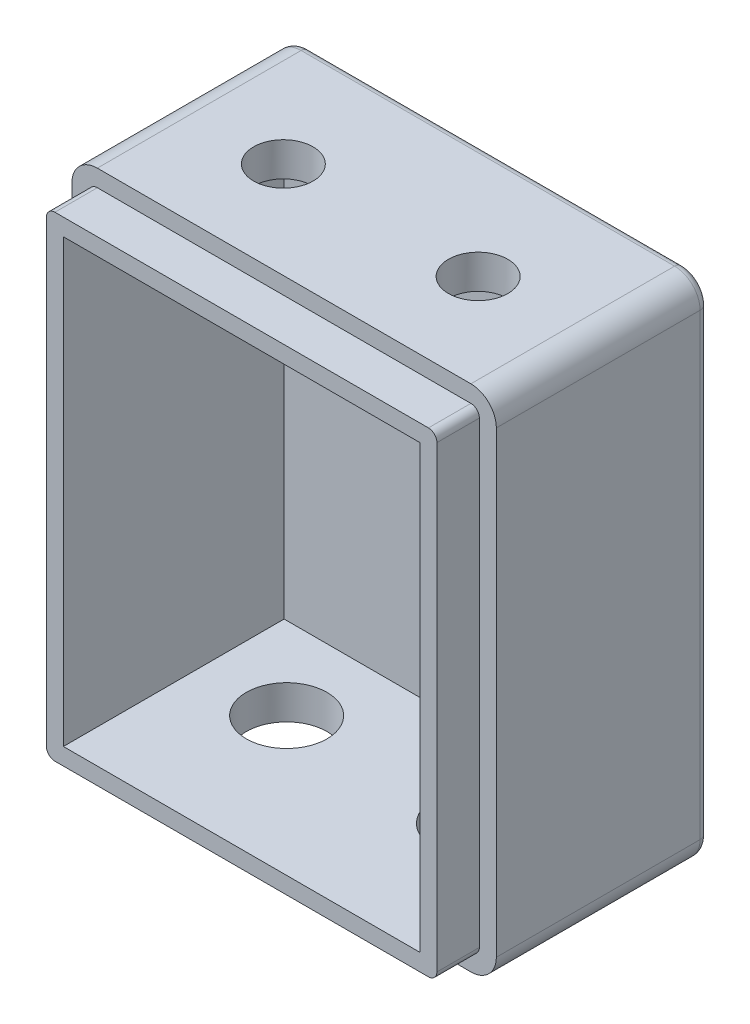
from build123d import *

# Parameters (mm, degrees)
SKETCH1_W           = 50
SKETCH1_H           = 60
BOSS_EXTRUDE1_DEPTH = 30
FILLET1_R           = 3
SHELL1_T            = -4
FILLET4_R           = 1
CUT_EXTRUDE1_DEPTH  = 5
CUT_EXTRUDE2_REACH  = 85.666
SKETCH4_R           = 4.75
CUT_EXTRUDE3_REACH  = 85.666
SKETCH5_R           = 3.5


with BuildPart() as part:
    # Sketch1 → Boss-Extrude1 (new body)
    with BuildSketch(Plane.XY):
        with Locations((25, 30)):
            Rectangle(SKETCH1_W, SKETCH1_H)
    extrude(amount=BOSS_EXTRUDE1_DEPTH)

    # Fillet1
    fillet1_edges = [part.edges().sort_by_distance(p)[0] for p in [
        (0, 60, 15),
        (50, 60, 15),
        (50, 0, 15),
        (0, 0, 15),
    ]]
    fillet(fillet1_edges, radius=FILLET1_R)

    # Shell1
    shell1_openings = [part.faces().sort_by_distance(p)[0] for p in [
        (25, 30, 30),
    ]]
    offset(amount=SHELL1_T, openings=shell1_openings, kind=Kind.INTERSECTION)

    # Fillet4
    fillet4_edges = [part.edges().sort_by_distance(p)[0] for p in [
        (50, 30, 0),
        (0, 30, 0),
        (25, 60, 0),
        (25, 0, 0),
        (49.121320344, 59.121320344, 0),
        (0.878679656, 59.121320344, 0),
        (0.878679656, 0.878679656, 0),
        (49.121320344, 0.878679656, 0),
    ]]
    fillet(fillet4_edges, radius=FILLET4_R)

    # Sketch3 → Cut-Extrude1 (cut)
    with BuildSketch(Plane.XY.offset(30)):
        with BuildLine():
            Line((3, 0), (47, 0))
            ThreePointArc((47, 0), (49.121320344, 0.878679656), (50, 3))
            Line((50, 3), (50, 57))
            ThreePointArc((50, 57), (49.121320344, 59.121320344), (47, 60))
            Line((47, 60), (3, 60))
            ThreePointArc((3, 60), (0.878679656, 59.121320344), (0, 57))
            Line((0, 57), (0, 3))
            ThreePointArc((0, 3), (0.878679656, 0.878679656), (3, 0))
        make_face()
        with BuildLine():
            Line((3, 2), (47, 2))
            ThreePointArc((47, 2), (47.707106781, 2.292893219), (48, 3))
            Line((48, 3), (48, 57))
            ThreePointArc((48, 57), (47.707106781, 57.707106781), (47, 58))
            Line((47, 58), (3, 58))
            ThreePointArc((3, 58), (2.292893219, 57.707106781), (2, 57))
            Line((2, 57), (2, 3))
            ThreePointArc((2, 3), (2.292893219, 2.292893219), (3, 2))
        make_face(mode=Mode.SUBTRACT)
    extrude(amount=-CUT_EXTRUDE1_DEPTH, mode=Mode.SUBTRACT)

    # Sketch4 → Cut-Extrude2 (cut, up to next)
    with BuildSketch(Plane.XZ, mode=Mode.PRIVATE) as cut_extrude2_sk1:
        with Locations(Location((36, 13.700185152, 0), (0, 0, 270))):
            Circle(SKETCH4_R)
    cut_extrude2_tool1 = extrude(cut_extrude2_sk1.sketch, amount=-CUT_EXTRUDE2_REACH, mode=Mode.PRIVATE) & part.part
    # Sketch4 → Cut-Extrude2 (cut, up to next)
    with BuildSketch(Plane.XZ, mode=Mode.PRIVATE) as cut_extrude2_sk2:
        with Locations(Location((14, 13.700185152, 0), (0, 0, 270))):
            Circle(SKETCH4_R)
    cut_extrude2_tool2 = extrude(cut_extrude2_sk2.sketch, amount=-CUT_EXTRUDE2_REACH, mode=Mode.PRIVATE) & part.part
    add(cut_extrude2_tool1.solids().sort_by_distance((36, 0, 13.700185))[0], mode=Mode.SUBTRACT)
    add(cut_extrude2_tool2.solids().sort_by_distance((14, 0, 13.700185))[0], mode=Mode.SUBTRACT)

    # Sketch5 → Cut-Extrude3 (cut, up to next)
    with BuildSketch(Plane(origin=(0, 60, 0), x_dir=(1, 0, 0), z_dir=(0, 1, 0)), mode=Mode.PRIVATE) as cut_extrude3_sk1:
        with Locations(Location((13.526922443, -13.618626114, 0), (0, 0, 270))):
            Circle(SKETCH5_R)
    cut_extrude3_tool1 = extrude(cut_extrude3_sk1.sketch, amount=-CUT_EXTRUDE3_REACH, mode=Mode.PRIVATE) & part.part
    # Sketch5 → Cut-Extrude3 (cut, up to next)
    with BuildSketch(Plane(origin=(0, 60, 0), x_dir=(1, 0, 0), z_dir=(0, 1, 0)), mode=Mode.PRIVATE) as cut_extrude3_sk2:
        with Locations(Location((36.473077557, -13.618626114, 0), (0, 0, 270))):
            Circle(SKETCH5_R)
    cut_extrude3_tool2 = extrude(cut_extrude3_sk2.sketch, amount=-CUT_EXTRUDE3_REACH, mode=Mode.PRIVATE) & part.part
    add(cut_extrude3_tool1.solids().sort_by_distance((13.526922, 60, 13.618626))[0], mode=Mode.SUBTRACT)
    add(cut_extrude3_tool2.solids().sort_by_distance((36.473078, 60, 13.618626))[0], mode=Mode.SUBTRACT)


solid = part.part
